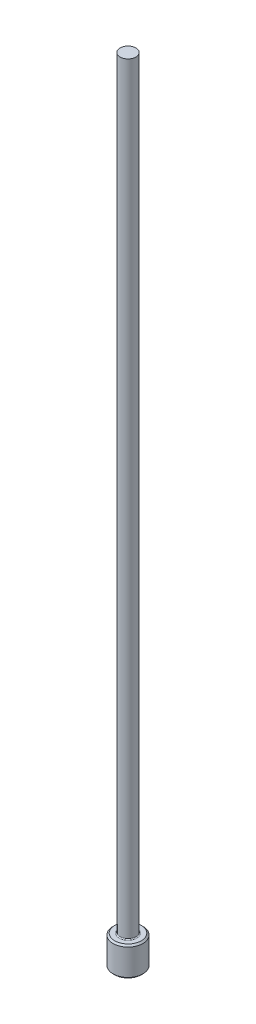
from build123d import *

# Parameters (mm, degrees)
CHAMFER1_SIZE = 0.127
FILLET1_R     = 0.0762


with BuildPart() as part:
    # Sketch1 → Revolve1 (revolve)
    with BuildSketch(Plane.XY, mode=Mode.PRIVATE) as revolve1_sk:
        Polygon((0, 0), (-1.1938, 0), (-1.1938, 2.3622), (-0.635, 2.3622), (-0.635, 63.5), (0, 63.5), align=None)
    revolve(revolve1_sk.sketch.rotate(Axis((0, 259.958771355, 0), (0, -1, 0)), 270), axis=Axis((0, 259.958771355, 0), (0, -1, 0)))

    # Chamfer1
    chamfer1_edges = [part.edges().sort_by_distance(p)[0] for p in [
        (0, 2.3622, -1.1938),
        (0, 0, -1.1938),
    ]]
    chamfer(chamfer1_edges, length=CHAMFER1_SIZE)

    # Fillet1
    fillet1_edges = [part.edges().sort_by_distance(p)[0] for p in [
        (0, 2.3622, -0.635),
    ]]
    fillet(fillet1_edges, radius=FILLET1_R)


solid = part.part
